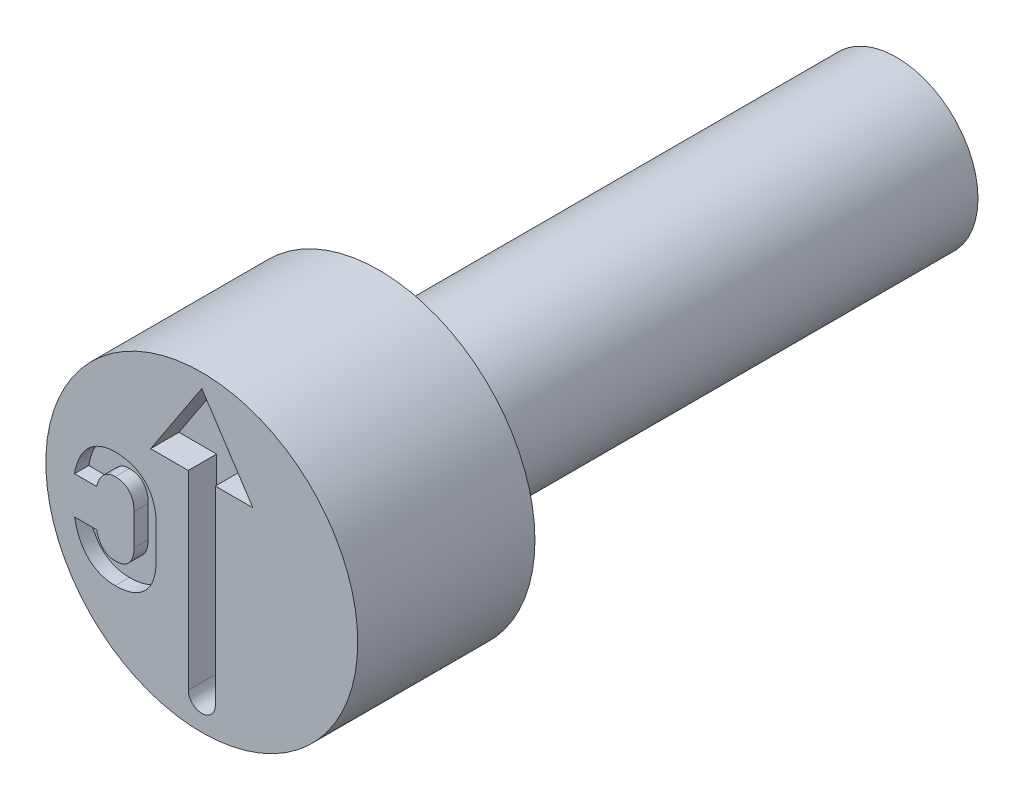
from build123d import *

# Parameters (mm, degrees)
CUT_EXTRUDE4_DEPTH = 0.4
CUT_EXTRUDE5_DEPTH = 0.2


with BuildPart() as part:
    # Sketch2 → Revolve1 (revolve)
    with BuildSketch(Plane(origin=(0, 0, 0), x_dir=(0, 0, -1), z_dir=(1, 0, 0)), mode=Mode.PRIVATE) as revolve1_sk:
        Polygon((0, 2.2), (0, 0), (9.8, 0), (9.8, 1.15), (2.5, 1.15), (2.5, 2.2), align=None)
    revolve(revolve1_sk.sketch.rotate(Axis((0, 0, -0.403888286), (0, 0, -1)), 90), axis=Axis((0, 0, -0.403888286), (0, 0, -1)))

    # Sketch3 → Cut-Extrude4 (cut)
    with BuildSketch(Plane.XY):
        with BuildLine():
            Line((0.190473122, 0.906351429), (0.190473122, -1.776161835))
            ThreePointArc((0.190473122, -1.776161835), (0, -1.966634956), (-0.190473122, -1.776161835))
            Line((-0.190473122, -1.776161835), (-0.190473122, 0.906351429))
            Line((-0.190473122, 0.906351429), (-0.721917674, 0.906351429))
            Line((-0.721917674, 0.906351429), (0, 2.002115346))
            Line((0, 2.002115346), (0.721917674, 0.906351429))
            Line((0.721917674, 0.906351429), (0.190473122, 0.906351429))
        make_face()
    extrude(amount=-CUT_EXTRUDE4_DEPTH, mode=Mode.SUBTRACT)

    # Sketch4 → Cut-Extrude5 (cut)
    with BuildSketch(Plane.XY):
        with BuildLine():
            add(Edge.make_bspline(
                [(-1.221907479, -1.016629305), (-1.20701133, -1.016468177), (-1.177616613, -1.016150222), (-1.134394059, -1.012841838), (-1.092694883, -1.007311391), (-1.052746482, -0.999512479), (-1.014438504, -0.989673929), (-0.97760694, -0.978045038), (-0.942606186, -0.963648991), (-0.909096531, -0.947323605), (-0.877549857, -0.928845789), (-0.848033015, -0.908062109), (-0.820253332, -0.885624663), (-0.79442163, -0.861083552), (-0.770564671, -0.834582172), (-0.748546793, -0.806091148), (-0.728820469, -0.775428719), (-0.710774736, -0.74300806), (-0.694719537, -0.708740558), (-0.681168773, -0.672462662), (-0.669420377, -0.634574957), (-0.659592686, -0.595083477), (-0.652068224, -0.553808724), (-0.647052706, -0.510782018), (-0.643575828, -0.465962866), (-0.643288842, -0.435480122), (-0.64314245, -0.419930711)],
                knots=[0, 0, 0, 0, 1.134237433, 2.238201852, 3.298772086, 4.336057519, 5.335809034, 6.309558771, 7.274828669, 8.21507465, 9.146315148, 10.055631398, 10.961815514, 11.863452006, 12.765999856, 13.674901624, 14.60241943, 15.539819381, 16.498894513, 17.481225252, 18.486546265, 19.518401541, 20.578551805, 21.679128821, 22.816111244, 24, 24, 24, 24], degree=3))
            Line((-0.64314245, -0.419930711), (-0.64314245, 0.018952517))
            add(Edge.make_bspline(
                [(-0.64314245, 0.018952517), (-0.643288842, 0.034501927), (-0.643575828, 0.064984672), (-0.647052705, 0.109803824), (-0.652068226, 0.152830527), (-0.659592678, 0.194105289), (-0.669420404, 0.233596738), (-0.681168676, 0.271484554), (-0.694719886, 0.307762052), (-0.710773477, 0.34203099), (-0.728825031, 0.374446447), (-0.748530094, 0.405127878), (-0.770675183, 0.433613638), (-0.794305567, 0.460426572), (-0.820267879, 0.484960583), (-0.848032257, 0.507406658), (-0.877538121, 0.528219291), (-0.909187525, 0.546593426), (-0.942504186, 0.563429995), (-0.977686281, 0.577597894), (-1.014366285, 0.589783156), (-1.052757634, 0.599479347), (-1.092691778, 0.607320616), (-1.134394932, 0.612839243), (-1.177616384, 0.616150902), (-1.207011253, 0.616468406), (-1.221907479, 0.616629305)],
                knots=[0, 0, 0, 0, 1.183277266, 2.319672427, 3.419680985, 4.479283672, 5.510605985, 6.515407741, 7.497231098, 8.455810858, 9.392726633, 10.319765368, 11.22819768, 12.136441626, 13.037612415, 13.943328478, 14.852175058, 15.782934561, 16.726365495, 17.691136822, 18.666946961, 19.666182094, 20.70293176, 21.7629542, 22.866348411, 24, 24, 24, 24], degree=3))
            add(Edge.make_bspline(
                [(-1.221907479, 0.616629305), (-1.246420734, 0.615973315), (-1.29447282, 0.61468741), (-1.36431279, 0.601776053), (-1.430264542, 0.581674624), (-1.491942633, 0.553011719), (-1.54915397, 0.516847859), (-1.601228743, 0.472847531), (-1.648149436, 0.421586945), (-1.689511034, 0.362856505), (-1.725431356, 0.297475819), (-1.755002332, 0.225436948), (-1.779005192, 0.147276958), (-1.789658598, 0.092437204), (-1.795129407, 0.064275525)],
                knots=[0, 0, 0, 0, 1.00806925, 1.976066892, 2.912865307, 3.839664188, 4.766819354, 5.690806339, 6.637604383, 7.619531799, 8.640729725, 9.701744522, 10.819784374, 12, 12, 12, 12], degree=3))
            Line((-1.795129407, 0.064275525), (-1.482759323, 0.064275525))
            add(Edge.make_bspline(
                [(-1.482759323, 0.064275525), (-1.479608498, 0.077056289), (-1.473477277, 0.101926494), (-1.460853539, 0.1373065), (-1.446499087, 0.170077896), (-1.428943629, 0.199459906), (-1.409832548, 0.226161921), (-1.38827967, 0.249295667), (-1.364756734, 0.269244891), (-1.33944538, 0.285744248), (-1.312414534, 0.299190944), (-1.283541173, 0.308090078), (-1.253223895, 0.31390123), (-1.232477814, 0.314641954), (-1.221907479, 0.31501936)],
                knots=[0, 0, 0, 0, 1.203096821, 2.341117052, 3.431111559, 4.469295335, 5.465369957, 6.42892467, 7.35290722, 8.279239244, 9.186115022, 10.104036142, 11.033987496, 12, 12, 12, 12], degree=3))
            add(Edge.make_bspline(
                [(-1.221907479, 0.31501936), (-1.208302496, 0.314543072), (-1.182031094, 0.313623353), (-1.143972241, 0.307631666), (-1.109304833, 0.296344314), (-1.077544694, 0.281370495), (-1.049172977, 0.261976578), (-1.02449379, 0.238201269), (-1.003494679, 0.21036721), (-0.985799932, 0.178953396), (-0.972118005, 0.143693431), (-0.962491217, 0.105022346), (-0.956533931, 0.063046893), (-0.955860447, 0.033972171), (-0.955512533, 0.018952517)],
                knots=[0, 0, 0, 0, 1.082677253, 2.090664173, 3.053339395, 3.973921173, 4.875832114, 5.774919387, 6.688160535, 7.640683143, 8.634736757, 9.687648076, 10.805466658, 12, 12, 12, 12], degree=3))
            Line((-0.955512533, 0.018952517), (-0.955512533, -0.419930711))
            add(Edge.make_bspline(
                [(-0.955512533, -0.419930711), (-0.955864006, -0.4349494), (-0.956544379, -0.464022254), (-0.962438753, -0.50590623), (-0.972190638, -0.544432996), (-0.985720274, -0.579536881), (-1.003492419, -0.61071692), (-1.02459814, -0.638224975), (-1.049159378, -0.661994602), (-1.077557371, -0.681334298), (-1.109236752, -0.696462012), (-1.14407629, -0.707095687), (-1.181983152, -0.713770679), (-1.208292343, -0.71459353), (-1.221907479, -0.71501936)],
                knots=[0, 0, 0, 0, 1.196920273, 2.316972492, 3.363591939, 4.359631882, 5.306515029, 6.214703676, 7.115587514, 8.019300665, 8.94172196, 9.903709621, 10.915159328, 12, 12, 12, 12], degree=3))
            add(Edge.make_bspline(
                [(-1.221907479, -0.71501936), (-1.232684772, -0.714594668), (-1.253823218, -0.713761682), (-1.284704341, -0.708662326), (-1.313779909, -0.699264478), (-1.341246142, -0.686602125), (-1.366901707, -0.670242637), (-1.390015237, -0.650029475), (-1.411544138, -0.627020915), (-1.430705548, -0.600467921), (-1.447691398, -0.570753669), (-1.461896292, -0.537866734), (-1.474226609, -0.502173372), (-1.479856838, -0.476951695), (-1.482759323, -0.46394946)],
                knots=[0, 0, 0, 0, 0.981077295, 1.924272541, 2.837745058, 3.753838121, 4.670304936, 5.59622504, 6.54113043, 7.532377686, 8.569122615, 9.649813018, 10.788435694, 12, 12, 12, 12], degree=3))
            Line((-1.482759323, -0.46394946), (-1.795129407, -0.46394946))
            add(Edge.make_bspline(
                [(-1.795129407, -0.46394946), (-1.789556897, -0.492222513), (-1.778722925, -0.54719047), (-1.754377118, -0.625468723), (-1.724375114, -0.697389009), (-1.688671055, -0.762843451), (-1.647047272, -0.821184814), (-1.600499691, -0.872631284), (-1.548634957, -0.916748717), (-1.491559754, -0.953093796), (-1.4299319, -0.981666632), (-1.364088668, -1.001732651), (-1.294369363, -1.014714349), (-1.246421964, -1.015981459), (-1.221907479, -1.016629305)],
                knots=[0, 0, 0, 0, 1.185884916, 2.305575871, 3.368634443, 4.390138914, 5.368714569, 6.312778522, 7.23993122, 8.163588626, 9.090665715, 10.027745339, 10.991628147, 12, 12, 12, 12], degree=3))
        make_face()
    extrude(amount=-CUT_EXTRUDE5_DEPTH, mode=Mode.SUBTRACT)


solid = part.part
